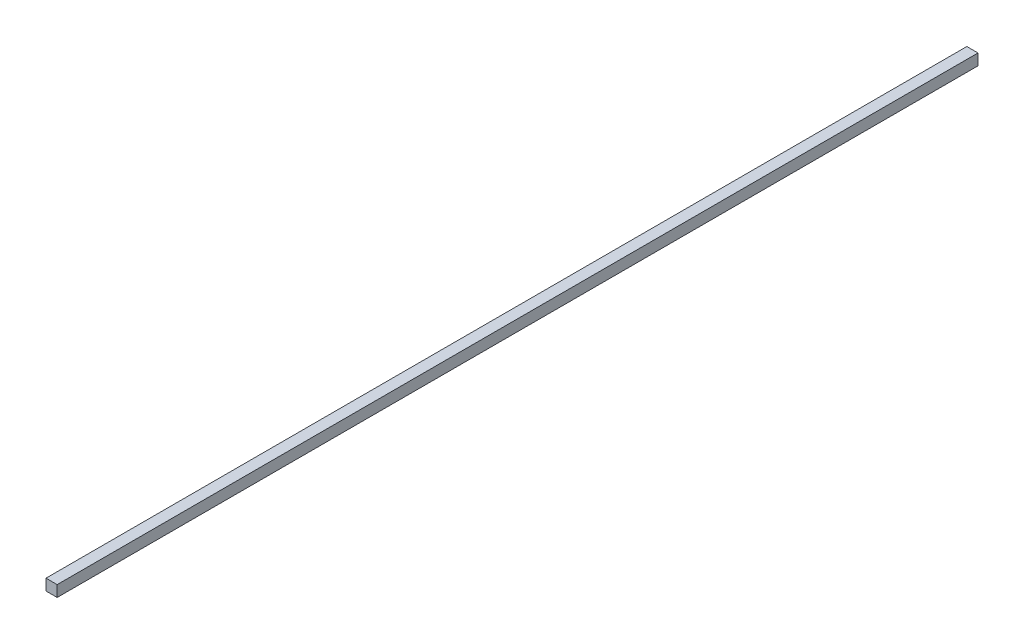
from build123d import *

# Parameters (mm, degrees)
ESQUISSE1_W      = 2
ESQUISSE1_H      = 2
EXTRUSION1_DEPTH = 82.5


with BuildPart() as part:
    # Esquisse1 → Extrusion1 (new, symmetric)
    with BuildSketch(Plane.XY):
        Rectangle(ESQUISSE1_W, ESQUISSE1_H)
    extrude(amount=EXTRUSION1_DEPTH, both=True)


solid = part.part
